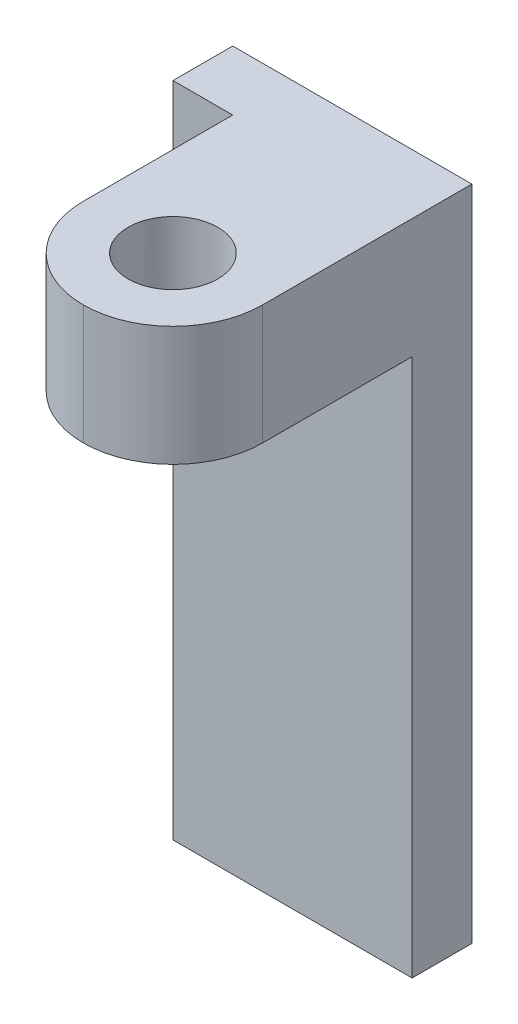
ISO-10303-21;
HEADER;
FILE_DESCRIPTION(('STEP AP214'),'2;1');
FILE_NAME('part.step','',(''),(''),'','','');
FILE_SCHEMA(('AUTOMOTIVE_DESIGN { 1 0 10303 214 1 1 1 1 }'));
ENDSEC;
DATA;
#1=APPLICATION_CONTEXT('core data for automotive mechanical design processes');
#2=APPLICATION_PROTOCOL_DEFINITION('international standard','automotive_design',2000,#1);
#3=PRODUCT_CONTEXT('',#1,'mechanical');
#4=PRODUCT('Part','Part','',(#3));
#5=PRODUCT_RELATED_PRODUCT_CATEGORY('part','',(#4));
#6=PRODUCT_DEFINITION_FORMATION('','',#4);
#7=PRODUCT_DEFINITION_CONTEXT('part definition',#1,'design');
#8=PRODUCT_DEFINITION('design','',#6,#7);
#9=PRODUCT_DEFINITION_SHAPE('','',#8);
#10=(LENGTH_UNIT() NAMED_UNIT(*) SI_UNIT(.MILLI.,.METRE.));
#11=(NAMED_UNIT(*) PLANE_ANGLE_UNIT() SI_UNIT($,.RADIAN.));
#12=(NAMED_UNIT(*) SI_UNIT($,.STERADIAN.) SOLID_ANGLE_UNIT());
#13=UNCERTAINTY_MEASURE_WITH_UNIT(LENGTH_MEASURE(1.E-05),#10,'distance_accuracy_value','');
#14=(GEOMETRIC_REPRESENTATION_CONTEXT(3) GLOBAL_UNCERTAINTY_ASSIGNED_CONTEXT((#13)) GLOBAL_UNIT_ASSIGNED_CONTEXT((#10,
#11,#12)) REPRESENTATION_CONTEXT('',''));
#15=CARTESIAN_POINT('',(0.,0.,0.));
#16=DIRECTION('',(0.,0.,1.));
#17=DIRECTION('',(1.,0.,0.));
#18=AXIS2_PLACEMENT_3D('',#15,#16,#17);
#19=CARTESIAN_POINT('',(25.4,-1.38777878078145E-13,12.7));
#20=DIRECTION('',(-1.,0.,0.));
#21=DIRECTION('',(0.,-1.,0.));
#22=AXIS2_PLACEMENT_3D('',#19,#20,#21);
#23=PLANE('',#22);
#24=DIRECTION('',(0.,0.,-1.));
#25=VECTOR('',#24,1.);
#26=CARTESIAN_POINT('',(25.4,139.7,12.7));
#27=LINE('',#26,#25);
#28=CARTESIAN_POINT('',(25.4,139.7,44.4499999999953));
#29=VERTEX_POINT('',#28);
#30=CARTESIAN_POINT('',(25.4,139.7,0.));
#31=VERTEX_POINT('',#30);
#32=EDGE_CURVE('E155',#29,#31,#27,.T.);
#33=ORIENTED_EDGE('',*,*,#32,.F.);
#34=DIRECTION('',(0.,1.,0.));
#35=VECTOR('',#34,1.);
#36=CARTESIAN_POINT('',(25.4000000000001,114.3,44.4499999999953));
#37=LINE('',#36,#35);
#38=CARTESIAN_POINT('',(25.4000000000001,114.3,44.4499999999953));
#39=VERTEX_POINT('',#38);
#40=EDGE_CURVE('E11',#29,#39,#37,.F.);
#41=ORIENTED_EDGE('',*,*,#40,.T.);
#42=DIRECTION('',(0.,0.,-1.));
#43=VECTOR('',#42,1.);
#44=CARTESIAN_POINT('',(25.4000000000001,114.3,63.4999999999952));
#45=LINE('',#44,#43);
#46=CARTESIAN_POINT('',(25.4000000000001,114.3,12.6999999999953));
#47=VERTEX_POINT('',#46);
#48=EDGE_CURVE('E103',#39,#47,#45,.T.);
#49=ORIENTED_EDGE('',*,*,#48,.T.);
#50=DIRECTION('',(0.,1.,0.));
#51=VECTOR('',#50,1.);
#52=CARTESIAN_POINT('',(25.4,-1.38777878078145E-13,12.7));
#53=LINE('',#52,#51);
#54=CARTESIAN_POINT('',(25.4,-1.38777878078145E-13,12.7));
#55=VERTEX_POINT('',#54);
#56=EDGE_CURVE('E117',#55,#47,#53,.T.);
#57=ORIENTED_EDGE('',*,*,#56,.F.);
#58=DIRECTION('',(0.,0.,-1.));
#59=VECTOR('',#58,1.);
#60=CARTESIAN_POINT('',(25.4,-1.38777878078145E-13,12.7));
#61=LINE('',#60,#59);
#62=CARTESIAN_POINT('',(25.4,-1.38777878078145E-13,0.));
#63=VERTEX_POINT('',#62);
#64=EDGE_CURVE('E161',#55,#63,#61,.T.);
#65=ORIENTED_EDGE('',*,*,#64,.T.);
#66=DIRECTION('',(0.,1.,0.));
#67=VECTOR('',#66,1.);
#68=CARTESIAN_POINT('',(25.4,-1.38777878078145E-13,0.));
#69=LINE('',#68,#67);
#70=EDGE_CURVE('E127',#63,#31,#69,.T.);
#71=ORIENTED_EDGE('',*,*,#70,.T.);
#72=EDGE_LOOP('',(#33,#41,#49,#57,#65,#71));
#73=FACE_BOUND('',#72,.T.);
#74=ADVANCED_FACE('F30',(#73),#23,.F.);
#75=CARTESIAN_POINT('',(-25.3999999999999,139.7,12.7));
#76=DIRECTION('',(0.,1.,0.));
#77=DIRECTION('',(0.,0.,1.));
#78=AXIS2_PLACEMENT_3D('',#75,#76,#77);
#79=PLANE('',#78);
#80=CARTESIAN_POINT('',(6.35000000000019,139.7,44.4499999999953));
#81=DIRECTION('',(0.,1.,0.));
#82=DIRECTION('',(0.,0.,1.));
#83=AXIS2_PLACEMENT_3D('',#80,#81,#82);
#84=CIRCLE('',#83,9.525);
#85=CARTESIAN_POINT('',(6.35000000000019,139.7,53.9749999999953));
#86=VERTEX_POINT('',#85);
#87=EDGE_CURVE('E190',#86,#86,#84,.F.);
#88=ORIENTED_EDGE('',*,*,#87,.T.);
#89=EDGE_LOOP('',(#88));
#90=FACE_BOUND('',#89,.T.);
#91=DIRECTION('',(0.,0.,-1.));
#92=VECTOR('',#91,1.);
#93=CARTESIAN_POINT('',(-12.7,139.7,63.4999999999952));
#94=LINE('',#93,#92);
#95=CARTESIAN_POINT('',(-12.7,139.7,44.4499999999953));
#96=VERTEX_POINT('',#95);
#97=CARTESIAN_POINT('',(-12.7,139.7,12.7));
#98=VERTEX_POINT('',#97);
#99=EDGE_CURVE('E102',#96,#98,#94,.T.);
#100=ORIENTED_EDGE('',*,*,#99,.F.);
#101=CARTESIAN_POINT('',(6.35000000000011,139.7,44.4499999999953));
#102=DIRECTION('',(0.,1.,0.));
#103=DIRECTION('',(0.,0.,1.));
#104=AXIS2_PLACEMENT_3D('',#101,#102,#103);
#105=CIRCLE('',#104,19.05);
#106=CARTESIAN_POINT('',(6.35000000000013,139.7,63.4999999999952));
#107=VERTEX_POINT('',#106);
#108=EDGE_CURVE('E182',#96,#107,#105,.T.);
#109=ORIENTED_EDGE('',*,*,#108,.T.);
#110=CARTESIAN_POINT('',(6.35000000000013,139.7,44.4499999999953));
#111=DIRECTION('',(0.,1.,0.));
#112=DIRECTION('',(0.,0.,1.));
#113=AXIS2_PLACEMENT_3D('',#110,#111,#112);
#114=CIRCLE('',#113,19.05);
#115=EDGE_CURVE('E184',#107,#29,#114,.T.);
#116=ORIENTED_EDGE('',*,*,#115,.T.);
#117=ORIENTED_EDGE('',*,*,#32,.T.);
#118=DIRECTION('',(1.,0.,0.));
#119=VECTOR('',#118,1.);
#120=CARTESIAN_POINT('',(-25.3999999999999,139.7,0.));
#121=LINE('',#120,#119);
#122=CARTESIAN_POINT('',(-25.3999999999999,139.7,0.));
#123=VERTEX_POINT('',#122);
#124=EDGE_CURVE('E142',#123,#31,#121,.T.);
#125=ORIENTED_EDGE('',*,*,#124,.F.);
#126=DIRECTION('',(0.,0.,-1.));
#127=VECTOR('',#126,1.);
#128=CARTESIAN_POINT('',(-25.3999999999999,139.7,12.7));
#129=LINE('',#128,#127);
#130=CARTESIAN_POINT('',(-25.3999999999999,139.7,12.7));
#131=VERTEX_POINT('',#130);
#132=EDGE_CURVE('E157',#131,#123,#129,.T.);
#133=ORIENTED_EDGE('',*,*,#132,.F.);
#134=DIRECTION('',(1.,0.,0.));
#135=VECTOR('',#134,1.);
#136=CARTESIAN_POINT('',(-25.3999999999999,139.7,12.7));
#137=LINE('',#136,#135);
#138=EDGE_CURVE('E133',#131,#98,#137,.T.);
#139=ORIENTED_EDGE('',*,*,#138,.T.);
#140=EDGE_LOOP('',(#100,#109,#116,#117,#125,#133,#139));
#141=FACE_BOUND('',#140,.T.);
#142=ADVANCED_FACE('F169',(#90,#141),#79,.T.);
#143=CARTESIAN_POINT('',(-25.3999999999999,139.7,12.7));
#144=DIRECTION('',(1.,0.,0.));
#145=DIRECTION('',(0.,0.,-1.));
#146=AXIS2_PLACEMENT_3D('',#143,#144,#145);
#147=PLANE('',#146);
#148=DIRECTION('',(0.,-1.,0.));
#149=VECTOR('',#148,1.);
#150=CARTESIAN_POINT('',(-25.3999999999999,139.7,0.));
#151=LINE('',#150,#149);
#152=CARTESIAN_POINT('',(-25.3999999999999,0.,0.));
#153=VERTEX_POINT('',#152);
#154=EDGE_CURVE('E145',#123,#153,#151,.T.);
#155=ORIENTED_EDGE('',*,*,#154,.T.);
#156=DIRECTION('',(0.,0.,-1.));
#157=VECTOR('',#156,1.);
#158=CARTESIAN_POINT('',(-25.3999999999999,0.,12.7));
#159=LINE('',#158,#157);
#160=CARTESIAN_POINT('',(-25.3999999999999,0.,12.7));
#161=VERTEX_POINT('',#160);
#162=EDGE_CURVE('E159',#161,#153,#159,.T.);
#163=ORIENTED_EDGE('',*,*,#162,.F.);
#164=DIRECTION('',(0.,-1.,0.));
#165=VECTOR('',#164,1.);
#166=CARTESIAN_POINT('',(-25.3999999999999,139.7,12.7));
#167=LINE('',#166,#165);
#168=EDGE_CURVE('E165',#131,#161,#167,.T.);
#169=ORIENTED_EDGE('',*,*,#168,.F.);
#170=ORIENTED_EDGE('',*,*,#132,.T.);
#171=EDGE_LOOP('',(#155,#163,#169,#170));
#172=FACE_BOUND('',#171,.T.);
#173=ADVANCED_FACE('F173',(#172),#147,.F.);
#174=CARTESIAN_POINT('',(25.4,-1.38777878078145E-13,12.7));
#175=DIRECTION('',(0.,-1.,0.));
#176=DIRECTION('',(0.,0.,-1.));
#177=AXIS2_PLACEMENT_3D('',#174,#175,#176);
#178=PLANE('',#177);
#179=DIRECTION('',(-1.,0.,0.));
#180=VECTOR('',#179,1.);
#181=CARTESIAN_POINT('',(25.4,-1.38777878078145E-13,0.));
#182=LINE('',#181,#180);
#183=EDGE_CURVE('E148',#63,#153,#182,.T.);
#184=ORIENTED_EDGE('',*,*,#183,.F.);
#185=ORIENTED_EDGE('',*,*,#64,.F.);
#186=DIRECTION('',(-1.,0.,0.));
#187=VECTOR('',#186,1.);
#188=CARTESIAN_POINT('',(25.4,-1.38777878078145E-13,12.7));
#189=LINE('',#188,#187);
#190=EDGE_CURVE('E163',#55,#161,#189,.T.);
#191=ORIENTED_EDGE('',*,*,#190,.T.);
#192=ORIENTED_EDGE('',*,*,#162,.T.);
#193=EDGE_LOOP('',(#184,#185,#191,#192));
#194=FACE_BOUND('',#193,.T.);
#195=ADVANCED_FACE('F176',(#194),#178,.T.);
#196=CARTESIAN_POINT('',(25.4,139.7,12.7));
#197=DIRECTION('',(0.,0.,-1.));
#198=DIRECTION('',(-1.,0.,0.));
#199=AXIS2_PLACEMENT_3D('',#196,#197,#198);
#200=PLANE('',#199);
#201=ORIENTED_EDGE('',*,*,#56,.T.);
#202=DIRECTION('',(-1.,0.,0.));
#203=VECTOR('',#202,1.);
#204=CARTESIAN_POINT('',(25.4000000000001,114.3,12.6999999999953));
#205=LINE('',#204,#203);
#206=CARTESIAN_POINT('',(-12.6999999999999,114.3,12.6999999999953));
#207=VERTEX_POINT('',#206);
#208=EDGE_CURVE('E96',#47,#207,#205,.T.);
#209=ORIENTED_EDGE('',*,*,#208,.T.);
#210=DIRECTION('',(0.,1.,0.));
#211=VECTOR('',#210,1.);
#212=CARTESIAN_POINT('',(-12.6999999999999,114.3,12.6999999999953));
#213=LINE('',#212,#211);
#214=EDGE_CURVE('E106',#207,#98,#213,.T.);
#215=ORIENTED_EDGE('',*,*,#214,.T.);
#216=ORIENTED_EDGE('',*,*,#138,.F.);
#217=ORIENTED_EDGE('',*,*,#168,.T.);
#218=ORIENTED_EDGE('',*,*,#190,.F.);
#219=EDGE_LOOP('',(#201,#209,#215,#216,#217,#218));
#220=FACE_BOUND('',#219,.T.);
#221=ADVANCED_FACE('F114',(#220),#200,.F.);
#222=CARTESIAN_POINT('',(25.4,139.7,0.));
#223=DIRECTION('',(0.,0.,-1.));
#224=DIRECTION('',(-1.,0.,0.));
#225=AXIS2_PLACEMENT_3D('',#222,#223,#224);
#226=PLANE('',#225);
#227=ORIENTED_EDGE('',*,*,#70,.F.);
#228=ORIENTED_EDGE('',*,*,#183,.T.);
#229=ORIENTED_EDGE('',*,*,#154,.F.);
#230=ORIENTED_EDGE('',*,*,#124,.T.);
#231=EDGE_LOOP('',(#227,#228,#229,#230));
#232=FACE_BOUND('',#231,.T.);
#233=ADVANCED_FACE('F218',(#232),#226,.T.);
#234=CARTESIAN_POINT('',(-12.6999999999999,114.3,63.4999999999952));
#235=DIRECTION('',(-1.,0.,0.));
#236=DIRECTION('',(0.,0.,1.));
#237=AXIS2_PLACEMENT_3D('',#234,#235,#236);
#238=PLANE('',#237);
#239=DIRECTION('',(0.,0.,-1.));
#240=VECTOR('',#239,1.);
#241=CARTESIAN_POINT('',(-12.6999999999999,114.3,63.4999999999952));
#242=LINE('',#241,#240);
#243=CARTESIAN_POINT('',(-12.6999999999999,114.3,44.4499999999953));
#244=VERTEX_POINT('',#243);
#245=EDGE_CURVE('E92',#244,#207,#242,.T.);
#246=ORIENTED_EDGE('',*,*,#245,.F.);
#247=DIRECTION('',(0.,1.,0.));
#248=VECTOR('',#247,1.);
#249=CARTESIAN_POINT('',(-12.6999999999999,114.3,44.4499999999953));
#250=LINE('',#249,#248);
#251=EDGE_CURVE('E128',#244,#96,#250,.T.);
#252=ORIENTED_EDGE('',*,*,#251,.T.);
#253=ORIENTED_EDGE('',*,*,#99,.T.);
#254=ORIENTED_EDGE('',*,*,#214,.F.);
#255=EDGE_LOOP('',(#246,#252,#253,#254));
#256=FACE_BOUND('',#255,.T.);
#257=ADVANCED_FACE('F107',(#256),#238,.T.);
#258=CARTESIAN_POINT('',(25.4000000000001,114.3,63.4999999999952));
#259=DIRECTION('',(0.,-1.,0.));
#260=DIRECTION('',(0.,0.,-1.));
#261=AXIS2_PLACEMENT_3D('',#258,#259,#260);
#262=PLANE('',#261);
#263=CARTESIAN_POINT('',(6.35000000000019,114.299999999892,44.4499999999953));
#264=DIRECTION('',(0.,-1.,0.));
#265=DIRECTION('',(0.,0.,-1.));
#266=AXIS2_PLACEMENT_3D('',#263,#264,#265);
#267=CIRCLE('',#266,9.525);
#268=CARTESIAN_POINT('',(6.35000000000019,114.299999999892,34.9249999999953));
#269=VERTEX_POINT('',#268);
#270=EDGE_CURVE('E188',#269,#269,#267,.T.);
#271=ORIENTED_EDGE('',*,*,#270,.F.);
#272=EDGE_LOOP('',(#271));
#273=FACE_BOUND('',#272,.T.);
#274=CARTESIAN_POINT('',(6.35000000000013,114.3,44.4499999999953));
#275=DIRECTION('',(0.,-1.,0.));
#276=DIRECTION('',(0.,0.,-1.));
#277=AXIS2_PLACEMENT_3D('',#274,#275,#276);
#278=CIRCLE('',#277,19.05);
#279=CARTESIAN_POINT('',(6.35000000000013,114.3,63.4999999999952));
#280=VERTEX_POINT('',#279);
#281=EDGE_CURVE('E44',#39,#280,#278,.T.);
#282=ORIENTED_EDGE('',*,*,#281,.T.);
#283=CARTESIAN_POINT('',(6.35000000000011,114.3,44.4499999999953));
#284=DIRECTION('',(0.,-1.,0.));
#285=DIRECTION('',(0.,0.,-1.));
#286=AXIS2_PLACEMENT_3D('',#283,#284,#285);
#287=CIRCLE('',#286,19.05);
#288=EDGE_CURVE('E37',#280,#244,#287,.T.);
#289=ORIENTED_EDGE('',*,*,#288,.T.);
#290=ORIENTED_EDGE('',*,*,#245,.T.);
#291=ORIENTED_EDGE('',*,*,#208,.F.);
#292=ORIENTED_EDGE('',*,*,#48,.F.);
#293=EDGE_LOOP('',(#282,#289,#290,#291,#292));
#294=FACE_BOUND('',#293,.T.);
#295=ADVANCED_FACE('F94',(#273,#294),#262,.T.);
#296=CARTESIAN_POINT('',(6.35000000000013,114.3,44.4499999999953));
#297=DIRECTION('',(0.,-1.,0.));
#298=DIRECTION('',(1.,0.,0.));
#299=AXIS2_PLACEMENT_3D('',#296,#297,#298);
#300=CYLINDRICAL_SURFACE('',#299,19.05);
#301=DIRECTION('',(0.,1.,0.));
#302=VECTOR('',#301,1.);
#303=CARTESIAN_POINT('',(6.35000000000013,114.3,63.4999999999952));
#304=LINE('',#303,#302);
#305=EDGE_CURVE('E112',#280,#107,#304,.T.);
#306=ORIENTED_EDGE('',*,*,#305,.F.);
#307=ORIENTED_EDGE('',*,*,#281,.F.);
#308=ORIENTED_EDGE('',*,*,#40,.F.);
#309=ORIENTED_EDGE('',*,*,#115,.F.);
#310=EDGE_LOOP('',(#306,#307,#308,#309));
#311=FACE_BOUND('',#310,.T.);
#312=ADVANCED_FACE('F179',(#311),#300,.T.);
#313=CARTESIAN_POINT('',(6.35000000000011,114.3,44.4499999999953));
#314=DIRECTION('',(0.,1.,0.));
#315=DIRECTION('',(0.,0.,1.));
#316=AXIS2_PLACEMENT_3D('',#313,#314,#315);
#317=CYLINDRICAL_SURFACE('',#316,19.05);
#318=ORIENTED_EDGE('',*,*,#288,.F.);
#319=ORIENTED_EDGE('',*,*,#305,.T.);
#320=ORIENTED_EDGE('',*,*,#108,.F.);
#321=ORIENTED_EDGE('',*,*,#251,.F.);
#322=EDGE_LOOP('',(#318,#319,#320,#321));
#323=FACE_BOUND('',#322,.T.);
#324=ADVANCED_FACE('F187',(#323),#317,.T.);
#325=CARTESIAN_POINT('',(6.35000000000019,139.70105,44.4499999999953));
#326=DIRECTION('',(0.,-1.,0.));
#327=DIRECTION('',(0.,0.,-1.));
#328=AXIS2_PLACEMENT_3D('',#325,#326,#327);
#329=CYLINDRICAL_SURFACE('',#328,9.525);
#330=ORIENTED_EDGE('',*,*,#87,.F.);
#331=EDGE_LOOP('',(#330));
#332=FACE_BOUND('',#331,.T.);
#333=ORIENTED_EDGE('',*,*,#270,.T.);
#334=EDGE_LOOP('',(#333));
#335=FACE_BOUND('',#334,.T.);
#336=ADVANCED_FACE('F198',(#332,#335),#329,.F.);
#337=CLOSED_SHELL('',(#74,#142,#173,#195,#221,#233,#257,#295,#312,#324,#336));
#338=MANIFOLD_SOLID_BREP('B2',#337);
#339=ADVANCED_BREP_SHAPE_REPRESENTATION('',(#18,#338),#14);
#340=SHAPE_DEFINITION_REPRESENTATION(#9,#339);
ENDSEC;
END-ISO-10303-21;
